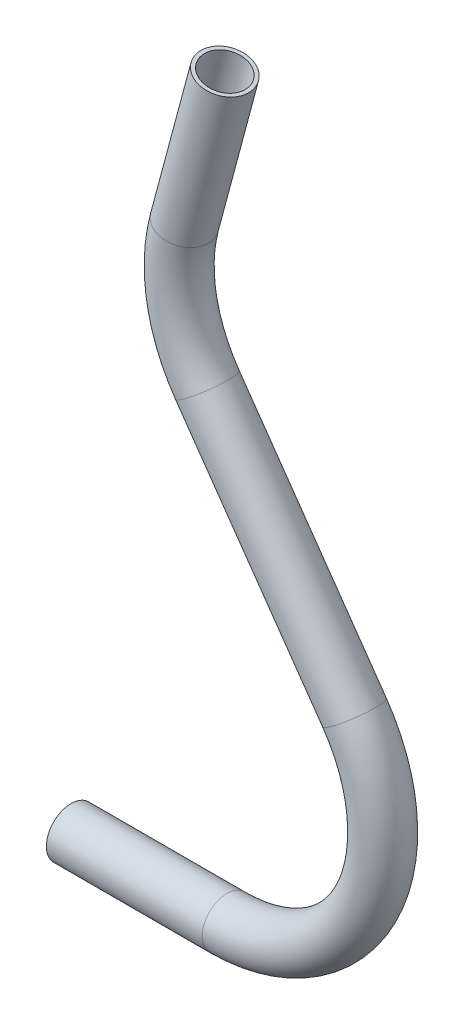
ISO-10303-21;
HEADER;
FILE_DESCRIPTION(('STEP AP214'),'2;1');
FILE_NAME('part.step','',(''),(''),'','','');
FILE_SCHEMA(('AUTOMOTIVE_DESIGN { 1 0 10303 214 1 1 1 1 }'));
ENDSEC;
DATA;
#1=APPLICATION_CONTEXT('core data for automotive mechanical design processes');
#2=APPLICATION_PROTOCOL_DEFINITION('international standard','automotive_design',2000,#1);
#3=PRODUCT_CONTEXT('',#1,'mechanical');
#4=PRODUCT('Part','Part','',(#3));
#5=PRODUCT_RELATED_PRODUCT_CATEGORY('part','',(#4));
#6=PRODUCT_DEFINITION_FORMATION('','',#4);
#7=PRODUCT_DEFINITION_CONTEXT('part definition',#1,'design');
#8=PRODUCT_DEFINITION('design','',#6,#7);
#9=PRODUCT_DEFINITION_SHAPE('','',#8);
#10=(LENGTH_UNIT() NAMED_UNIT(*) SI_UNIT(.MILLI.,.METRE.));
#11=(NAMED_UNIT(*) PLANE_ANGLE_UNIT() SI_UNIT($,.RADIAN.));
#12=(NAMED_UNIT(*) SI_UNIT($,.STERADIAN.) SOLID_ANGLE_UNIT());
#13=UNCERTAINTY_MEASURE_WITH_UNIT(LENGTH_MEASURE(1.E-05),#10,'distance_accuracy_value','');
#14=(GEOMETRIC_REPRESENTATION_CONTEXT(3) GLOBAL_UNCERTAINTY_ASSIGNED_CONTEXT((#13)) GLOBAL_UNIT_ASSIGNED_CONTEXT((#10,
#11,#12)) REPRESENTATION_CONTEXT('',''));
#15=CARTESIAN_POINT('',(0.,0.,0.));
#16=DIRECTION('',(0.,0.,1.));
#17=DIRECTION('',(1.,0.,0.));
#18=AXIS2_PLACEMENT_3D('',#15,#16,#17);
#19=CARTESIAN_POINT('',(61.8514512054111,319.188899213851,0.));
#20=DIRECTION('',(0.258819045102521,0.965925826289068,0.));
#21=DIRECTION('',(-0.965925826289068,0.258819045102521,0.));
#22=AXIS2_PLACEMENT_3D('',#19,#20,#21);
#23=CYLINDRICAL_SURFACE('',#22,13.5);
#24=CARTESIAN_POINT('',(61.8514512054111,319.188899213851,0.));
#25=DIRECTION('',(0.258819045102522,0.965925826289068,0.));
#26=DIRECTION('',(0.,0.,-1.));
#27=AXIS2_PLACEMENT_3D('',#24,#25,#26);
#28=CIRCLE('',#27,13.5);
#29=CARTESIAN_POINT('',(48.8114525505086,322.682956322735,0.));
#30=VERTEX_POINT('',#29);
#31=EDGE_CURVE('E42',#30,#30,#28,.T.);
#32=ORIENTED_EDGE('',*,*,#31,.T.);
#33=EDGE_LOOP('',(#32));
#34=FACE_BOUND('',#33,.T.);
#35=CARTESIAN_POINT('',(83.8510700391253,401.292594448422,0.));
#36=DIRECTION('',(0.258819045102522,0.965925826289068,0.));
#37=DIRECTION('',(0.,0.,-1.));
#38=AXIS2_PLACEMENT_3D('',#35,#36,#37);
#39=CIRCLE('',#38,13.5);
#40=CARTESIAN_POINT('',(83.8510700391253,401.292594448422,-13.5));
#41=VERTEX_POINT('',#40);
#42=EDGE_CURVE('E10',#41,#41,#39,.T.);
#43=ORIENTED_EDGE('',*,*,#42,.F.);
#44=EDGE_LOOP('',(#43));
#45=FACE_BOUND('',#44,.T.);
#46=ADVANCED_FACE('F32',(#34,#45),#23,.T.);
#47=CARTESIAN_POINT('',(61.8514512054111,319.188899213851,0.));
#48=DIRECTION('',(0.258819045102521,0.965925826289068,0.));
#49=DIRECTION('',(-0.965925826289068,0.258819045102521,0.));
#50=AXIS2_PLACEMENT_3D('',#47,#48,#49);
#51=CYLINDRICAL_SURFACE('',#50,11.5);
#52=CARTESIAN_POINT('',(61.8514512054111,319.188899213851,0.));
#53=DIRECTION('',(0.258819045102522,0.965925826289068,0.));
#54=DIRECTION('',(0.,0.,-1.));
#55=AXIS2_PLACEMENT_3D('',#52,#53,#54);
#56=CIRCLE('',#55,11.5);
#57=CARTESIAN_POINT('',(50.7433042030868,322.16531823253,0.));
#58=VERTEX_POINT('',#57);
#59=EDGE_CURVE('E46',#58,#58,#56,.T.);
#60=ORIENTED_EDGE('',*,*,#59,.F.);
#61=EDGE_LOOP('',(#60));
#62=FACE_BOUND('',#61,.T.);
#63=CARTESIAN_POINT('',(83.8510700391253,401.292594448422,0.));
#64=DIRECTION('',(0.258819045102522,0.965925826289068,0.));
#65=DIRECTION('',(0.,0.,-1.));
#66=AXIS2_PLACEMENT_3D('',#63,#64,#65);
#67=CIRCLE('',#66,11.5);
#68=CARTESIAN_POINT('',(83.8510700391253,401.292594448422,-11.5));
#69=VERTEX_POINT('',#68);
#70=EDGE_CURVE('E38',#69,#69,#67,.T.);
#71=ORIENTED_EDGE('',*,*,#70,.T.);
#72=EDGE_LOOP('',(#71));
#73=FACE_BOUND('',#72,.T.);
#74=ADVANCED_FACE('F96',(#62,#73),#51,.F.);
#75=CARTESIAN_POINT('',(143.955146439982,297.189280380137,0.));
#76=DIRECTION('',(0.,0.,-1.));
#77=DIRECTION('',(-1.,0.,0.));
#78=AXIS2_PLACEMENT_3D('',#75,#76,#77);
#79=TOROIDAL_SURFACE('',#78,85.,13.5);
#80=CARTESIAN_POINT('',(74.3272226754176,248.435283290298,0.));
#81=DIRECTION('',(-0.573576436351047,0.819152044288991,0.));
#82=DIRECTION('',(0.,0.,-1.));
#83=AXIS2_PLACEMENT_3D('',#80,#81,#82);
#84=CIRCLE('',#83,13.5);
#85=CARTESIAN_POINT('',(63.2686700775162,240.692001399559,0.));
#86=VERTEX_POINT('',#85);
#87=EDGE_CURVE('E51',#86,#86,#84,.T.);
#88=CARTESIAN_POINT('',(143.955146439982,297.189280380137,0.));
#89=DIRECTION('',(0.,0.,-1.));
#90=DIRECTION('',(-1.,0.,0.));
#91=AXIS2_PLACEMENT_3D('',#88,#89,#90);
#92=CIRCLE('',#91,98.5);
#93=EDGE_CURVE('',#86,#30,#92,.T.);
#94=ORIENTED_EDGE('',*,*,#87,.T.);
#95=ORIENTED_EDGE('',*,*,#31,.F.);
#96=ORIENTED_EDGE('',*,*,#93,.T.);
#97=ORIENTED_EDGE('',*,*,#93,.F.);
#98=EDGE_LOOP('',(#94,#96,#95,#97));
#99=FACE_BOUND('',#98,.T.);
#100=ADVANCED_FACE('F101',(#99),#79,.T.);
#101=CARTESIAN_POINT('',(143.955146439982,297.189280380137,0.));
#102=DIRECTION('',(0.,0.,-1.));
#103=DIRECTION('',(-1.,0.,0.));
#104=AXIS2_PLACEMENT_3D('',#101,#102,#103);
#105=TOROIDAL_SURFACE('',#104,85.,11.5);
#106=CARTESIAN_POINT('',(74.3272226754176,248.435283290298,0.));
#107=DIRECTION('',(-0.573576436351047,0.819152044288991,0.));
#108=DIRECTION('',(0.,0.,-1.));
#109=AXIS2_PLACEMENT_3D('',#106,#107,#108);
#110=CIRCLE('',#109,11.5);
#111=CARTESIAN_POINT('',(64.9069741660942,241.839154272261,0.));
#112=VERTEX_POINT('',#111);
#113=EDGE_CURVE('E54',#112,#112,#110,.T.);
#114=CARTESIAN_POINT('',(143.955146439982,297.189280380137,0.));
#115=DIRECTION('',(0.,0.,-1.));
#116=DIRECTION('',(-1.,0.,0.));
#117=AXIS2_PLACEMENT_3D('',#114,#115,#116);
#118=CIRCLE('',#117,96.5);
#119=EDGE_CURVE('',#112,#58,#118,.T.);
#120=ORIENTED_EDGE('',*,*,#113,.F.);
#121=ORIENTED_EDGE('',*,*,#59,.T.);
#122=ORIENTED_EDGE('',*,*,#119,.T.);
#123=ORIENTED_EDGE('',*,*,#119,.F.);
#124=EDGE_LOOP('',(#120,#122,#121,#123));
#125=FACE_BOUND('',#124,.T.);
#126=ADVANCED_FACE('F107',(#125),#105,.F.);
#127=CARTESIAN_POINT('',(154.627923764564,133.753997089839,0.));
#128=DIRECTION('',(-0.573576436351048,0.819152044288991,0.));
#129=DIRECTION('',(-0.819152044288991,-0.573576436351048,0.));
#130=AXIS2_PLACEMENT_3D('',#127,#128,#129);
#131=CYLINDRICAL_SURFACE('',#130,13.5);
#132=CARTESIAN_POINT('',(154.627923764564,133.753997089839,0.));
#133=DIRECTION('',(-0.573576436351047,0.819152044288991,0.));
#134=DIRECTION('',(0.,0.,-1.));
#135=AXIS2_PLACEMENT_3D('',#132,#133,#134);
#136=CIRCLE('',#135,13.5);
#137=CARTESIAN_POINT('',(165.686476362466,141.497278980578,0.));
#138=VERTEX_POINT('',#137);
#139=EDGE_CURVE('E57',#138,#138,#136,.T.);
#140=ORIENTED_EDGE('',*,*,#139,.T.);
#141=EDGE_LOOP('',(#140));
#142=FACE_BOUND('',#141,.T.);
#143=ORIENTED_EDGE('',*,*,#87,.F.);
#144=EDGE_LOOP('',(#143));
#145=FACE_BOUND('',#144,.T.);
#146=ADVANCED_FACE('F113',(#142,#145),#131,.T.);
#147=CARTESIAN_POINT('',(154.627923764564,133.753997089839,0.));
#148=DIRECTION('',(-0.573576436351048,0.819152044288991,0.));
#149=DIRECTION('',(-0.819152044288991,-0.573576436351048,0.));
#150=AXIS2_PLACEMENT_3D('',#147,#148,#149);
#151=CYLINDRICAL_SURFACE('',#150,11.5);
#152=CARTESIAN_POINT('',(154.627923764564,133.753997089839,0.));
#153=DIRECTION('',(-0.573576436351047,0.819152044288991,0.));
#154=DIRECTION('',(0.,0.,-1.));
#155=AXIS2_PLACEMENT_3D('',#152,#153,#154);
#156=CIRCLE('',#155,11.5);
#157=CARTESIAN_POINT('',(164.048172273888,140.350126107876,0.));
#158=VERTEX_POINT('',#157);
#159=EDGE_CURVE('E60',#158,#158,#156,.T.);
#160=ORIENTED_EDGE('',*,*,#159,.F.);
#161=EDGE_LOOP('',(#160));
#162=FACE_BOUND('',#161,.T.);
#163=ORIENTED_EDGE('',*,*,#113,.T.);
#164=EDGE_LOOP('',(#163));
#165=FACE_BOUND('',#164,.T.);
#166=ADVANCED_FACE('F119',(#162,#165),#151,.F.);
#167=CARTESIAN_POINT('',(85.,85.,0.));
#168=DIRECTION('',(0.,0.,1.));
#169=DIRECTION('',(1.,0.,0.));
#170=AXIS2_PLACEMENT_3D('',#167,#168,#169);
#171=TOROIDAL_SURFACE('',#170,85.,13.5);
#172=CARTESIAN_POINT('',(85.,0.,0.));
#173=DIRECTION('',(1.,0.,0.));
#174=DIRECTION('',(0.,0.,-1.));
#175=AXIS2_PLACEMENT_3D('',#172,#173,#174);
#176=CIRCLE('',#175,13.5);
#177=CARTESIAN_POINT('',(85.,-13.5,0.));
#178=VERTEX_POINT('',#177);
#179=EDGE_CURVE('E63',#178,#178,#176,.T.);
#180=CARTESIAN_POINT('',(85.,85.,0.));
#181=DIRECTION('',(0.,0.,1.));
#182=DIRECTION('',(1.,0.,0.));
#183=AXIS2_PLACEMENT_3D('',#180,#181,#182);
#184=CIRCLE('',#183,98.5);
#185=EDGE_CURVE('',#178,#138,#184,.T.);
#186=ORIENTED_EDGE('',*,*,#179,.T.);
#187=ORIENTED_EDGE('',*,*,#139,.F.);
#188=ORIENTED_EDGE('',*,*,#185,.T.);
#189=ORIENTED_EDGE('',*,*,#185,.F.);
#190=EDGE_LOOP('',(#186,#188,#187,#189));
#191=FACE_BOUND('',#190,.T.);
#192=ADVANCED_FACE('F92',(#191),#171,.T.);
#193=CARTESIAN_POINT('',(85.,85.,0.));
#194=DIRECTION('',(0.,0.,1.));
#195=DIRECTION('',(1.,0.,0.));
#196=AXIS2_PLACEMENT_3D('',#193,#194,#195);
#197=TOROIDAL_SURFACE('',#196,85.,11.5);
#198=CARTESIAN_POINT('',(85.,0.,0.));
#199=DIRECTION('',(1.,0.,0.));
#200=DIRECTION('',(0.,0.,-1.));
#201=AXIS2_PLACEMENT_3D('',#198,#199,#200);
#202=CIRCLE('',#201,11.5);
#203=CARTESIAN_POINT('',(85.,-11.5,0.));
#204=VERTEX_POINT('',#203);
#205=EDGE_CURVE('E66',#204,#204,#202,.T.);
#206=CARTESIAN_POINT('',(85.,85.,0.));
#207=DIRECTION('',(0.,0.,1.));
#208=DIRECTION('',(1.,0.,0.));
#209=AXIS2_PLACEMENT_3D('',#206,#207,#208);
#210=CIRCLE('',#209,96.5);
#211=EDGE_CURVE('',#204,#158,#210,.T.);
#212=ORIENTED_EDGE('',*,*,#205,.F.);
#213=ORIENTED_EDGE('',*,*,#159,.T.);
#214=ORIENTED_EDGE('',*,*,#211,.T.);
#215=ORIENTED_EDGE('',*,*,#211,.F.);
#216=EDGE_LOOP('',(#212,#214,#213,#215));
#217=FACE_BOUND('',#216,.T.);
#218=ADVANCED_FACE('F82',(#217),#197,.F.);
#219=CARTESIAN_POINT('',(85.,0.,0.));
#220=DIRECTION('',(-1.,0.,0.));
#221=DIRECTION('',(0.,0.,1.));
#222=AXIS2_PLACEMENT_3D('',#219,#220,#221);
#223=CYLINDRICAL_SURFACE('',#222,11.5);
#224=ORIENTED_EDGE('',*,*,#205,.T.);
#225=EDGE_LOOP('',(#224));
#226=FACE_BOUND('',#225,.T.);
#227=CARTESIAN_POINT('',(0.,0.,0.));
#228=DIRECTION('',(1.,0.,0.));
#229=DIRECTION('',(0.,0.,-1.));
#230=AXIS2_PLACEMENT_3D('',#227,#228,#229);
#231=CIRCLE('',#230,11.5);
#232=CARTESIAN_POINT('',(0.,0.,-11.5));
#233=VERTEX_POINT('',#232);
#234=EDGE_CURVE('E72',#233,#233,#231,.T.);
#235=ORIENTED_EDGE('',*,*,#234,.F.);
#236=EDGE_LOOP('',(#235));
#237=FACE_BOUND('',#236,.T.);
#238=ADVANCED_FACE('F79',(#226,#237),#223,.F.);
#239=CARTESIAN_POINT('',(85.,0.,0.));
#240=DIRECTION('',(-1.,0.,0.));
#241=DIRECTION('',(0.,0.,1.));
#242=AXIS2_PLACEMENT_3D('',#239,#240,#241);
#243=CYLINDRICAL_SURFACE('',#242,13.5);
#244=ORIENTED_EDGE('',*,*,#179,.F.);
#245=EDGE_LOOP('',(#244));
#246=FACE_BOUND('',#245,.T.);
#247=CARTESIAN_POINT('',(0.,0.,0.));
#248=DIRECTION('',(1.,0.,0.));
#249=DIRECTION('',(0.,0.,-1.));
#250=AXIS2_PLACEMENT_3D('',#247,#248,#249);
#251=CIRCLE('',#250,13.5);
#252=CARTESIAN_POINT('',(0.,0.,-13.5));
#253=VERTEX_POINT('',#252);
#254=EDGE_CURVE('E69',#253,#253,#251,.T.);
#255=ORIENTED_EDGE('',*,*,#254,.T.);
#256=EDGE_LOOP('',(#255));
#257=FACE_BOUND('',#256,.T.);
#258=ADVANCED_FACE('F81',(#246,#257),#243,.T.);
#259=CARTESIAN_POINT('',(83.8510700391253,401.292594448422,0.));
#260=DIRECTION('',(0.258819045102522,0.965925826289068,0.));
#261=DIRECTION('',(0.,0.,-1.));
#262=AXIS2_PLACEMENT_3D('',#259,#260,#261);
#263=PLANE('',#262);
#264=ORIENTED_EDGE('',*,*,#70,.F.);
#265=EDGE_LOOP('',(#264));
#266=FACE_BOUND('',#265,.T.);
#267=ORIENTED_EDGE('',*,*,#42,.T.);
#268=EDGE_LOOP('',(#267));
#269=FACE_BOUND('',#268,.T.);
#270=ADVANCED_FACE('F89',(#266,#269),#263,.T.);
#271=CARTESIAN_POINT('',(0.,0.,0.));
#272=DIRECTION('',(1.,0.,0.));
#273=DIRECTION('',(0.,0.,-1.));
#274=AXIS2_PLACEMENT_3D('',#271,#272,#273);
#275=PLANE('',#274);
#276=ORIENTED_EDGE('',*,*,#234,.T.);
#277=EDGE_LOOP('',(#276));
#278=FACE_BOUND('',#277,.T.);
#279=ORIENTED_EDGE('',*,*,#254,.F.);
#280=EDGE_LOOP('',(#279));
#281=FACE_BOUND('',#280,.T.);
#282=ADVANCED_FACE('F76',(#278,#281),#275,.F.);
#283=CLOSED_SHELL('',(#46,#74,#100,#126,#146,#166,#192,#218,#238,#258,#270,#282));
#284=MANIFOLD_SOLID_BREP('B2',#283);
#285=ADVANCED_BREP_SHAPE_REPRESENTATION('',(#18,#284),#14);
#286=SHAPE_DEFINITION_REPRESENTATION(#9,#285);
ENDSEC;
END-ISO-10303-21;
